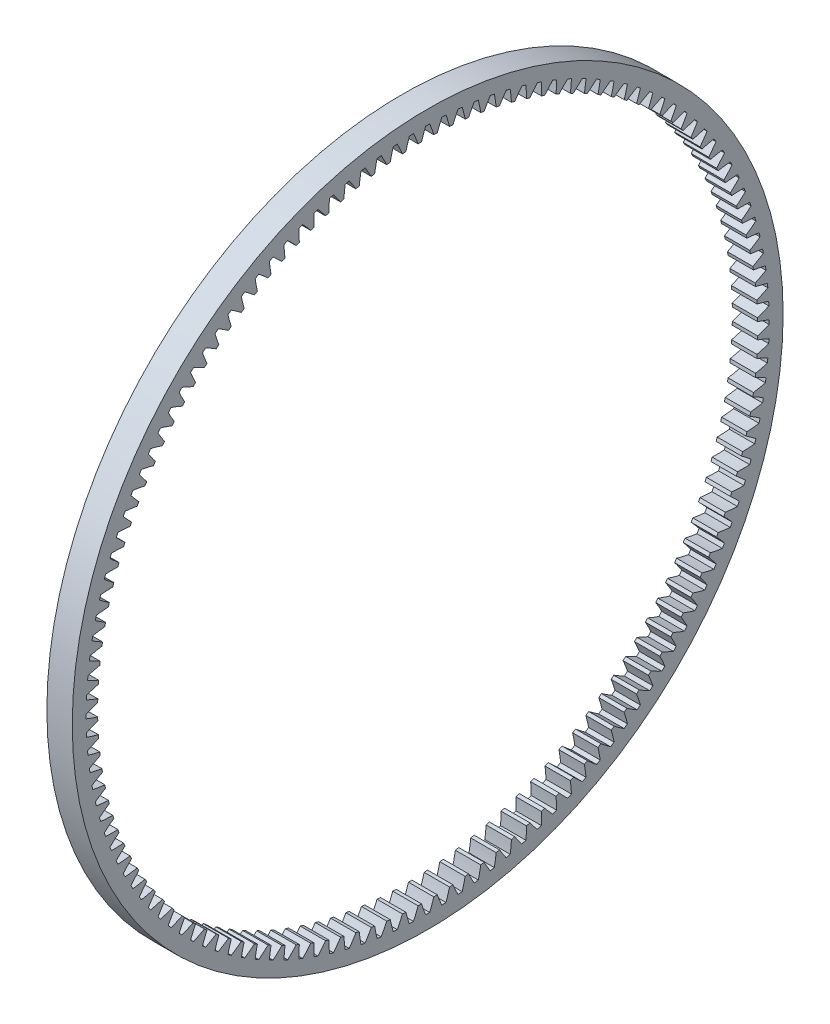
from build123d import *

# Parameters (mm, degrees)
BASPROSKE_W     = 15
BASPROSKE_H     = 15
TOOTHCUT_DEPTH  = 298.363414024
TEETHCUTS_COUNT = 132
TEETHCUTS_ANGLE = 357.272727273


with BuildPart() as part:
    # BasProSke → Base-Revolve (revolve)
    with BuildSketch(Plane(origin=(0, 0, 0), x_dir=(1, 0, 0), z_dir=(0, 1, 0)), mode=Mode.PRIVATE) as base_revolve_sk:
        with Locations((7.5, 202.5)):
            Rectangle(BASPROSKE_W, BASPROSKE_H)
    revolve(base_revolve_sk.sketch.rotate(Axis((-10, 0, 0), (1, 0, 0)), 180), axis=Axis((-10, 0, 0), (1, 0, 0)))

    # TooCutSke → ToothCut (cut, through all)
    with BuildSketch(Plane(origin=(0, 0, 0), x_dir=(0, 0, -1), z_dir=(1, 0, 0))):
        with BuildLine():
            ThreePointArc((3.631145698, 194.940784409), (2.488846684, 198.3660068), (1.222405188, 201.747296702))
            ThreePointArc((1.222405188, 201.747296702), (0, 201.751), (-1.222405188, 201.747296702))
            ThreePointArc((-1.222405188, 201.747296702), (-2.488846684, 198.3660068), (-3.631145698, 194.940784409))
            ThreePointArc((-3.631145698, 194.940784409), (0, 194.9746), (3.631145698, 194.940784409))
        make_face()
    toothcut = extrude(amount=TOOTHCUT_DEPTH, mode=Mode.SUBTRACT)

    # TeethCuts: ToothCut ×132 about axis
    teethcuts_axis = Axis((-10, 0, 0), (1, 0, 0))
    for i in range(1, TEETHCUTS_COUNT):
        add(toothcut.rotate(teethcuts_axis, i * TEETHCUTS_ANGLE / (TEETHCUTS_COUNT - 1)), mode=Mode.SUBTRACT)


solid = part.part
